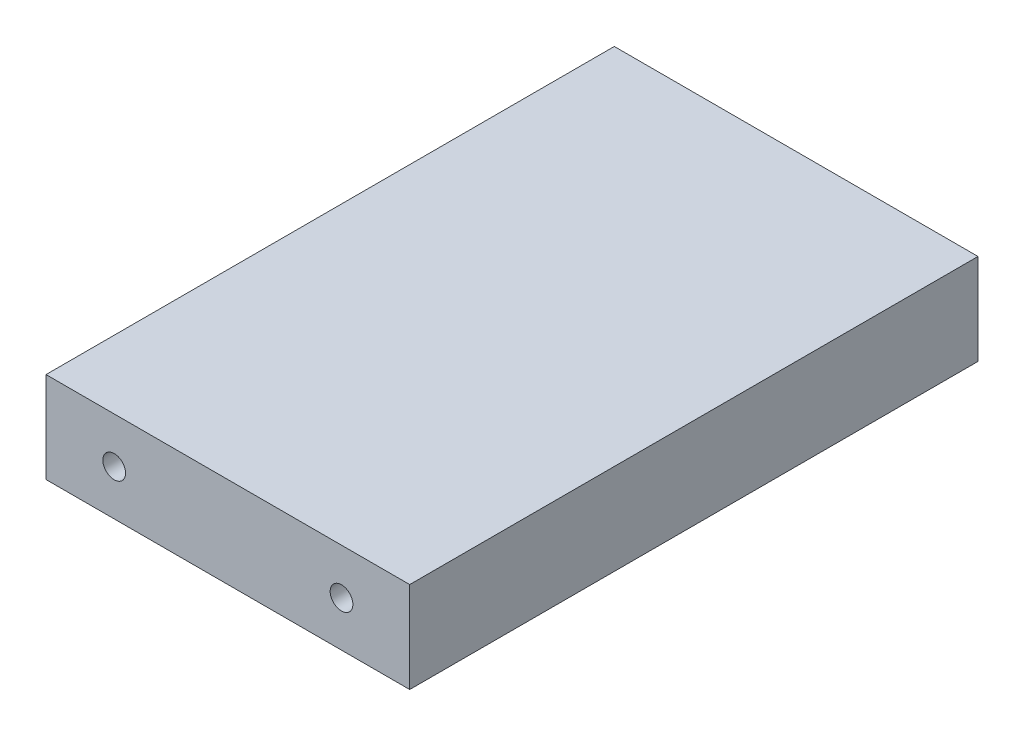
from build123d import *

# Parameters (mm, degrees)
ESQUISSE1_W           = 80
ESQUISSE1_H           = 20
BOSS_EXTRU_1_DEPTH    = 125
TROU_TARAUD_M61_D     = 5
TROU_TARAUD_M61_DEPTH = 27
TROU_TARAUD_M61_TIP   = 1.502151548


with BuildPart() as part:
    # Esquisse1 → Boss.-Extru.1 (new body)
    with BuildSketch(Plane.XY):
        with Locations((-40, 10)):
            Rectangle(ESQUISSE1_W, ESQUISSE1_H)
    extrude(amount=BOSS_EXTRU_1_DEPTH)

    # Trou taraud_ M61
    with Locations(Plane.XY.offset(125)):
        with Locations((-65, 9.958646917), (-15, 9.958646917)):
            Hole(TROU_TARAUD_M61_D / 2, depth=TROU_TARAUD_M61_DEPTH)
            with Locations((0, 0, -(TROU_TARAUD_M61_DEPTH + TROU_TARAUD_M61_TIP / 2))):  # 118° drill point
                Cone(0, TROU_TARAUD_M61_D / 2, TROU_TARAUD_M61_TIP, mode=Mode.SUBTRACT)


solid = part.part
